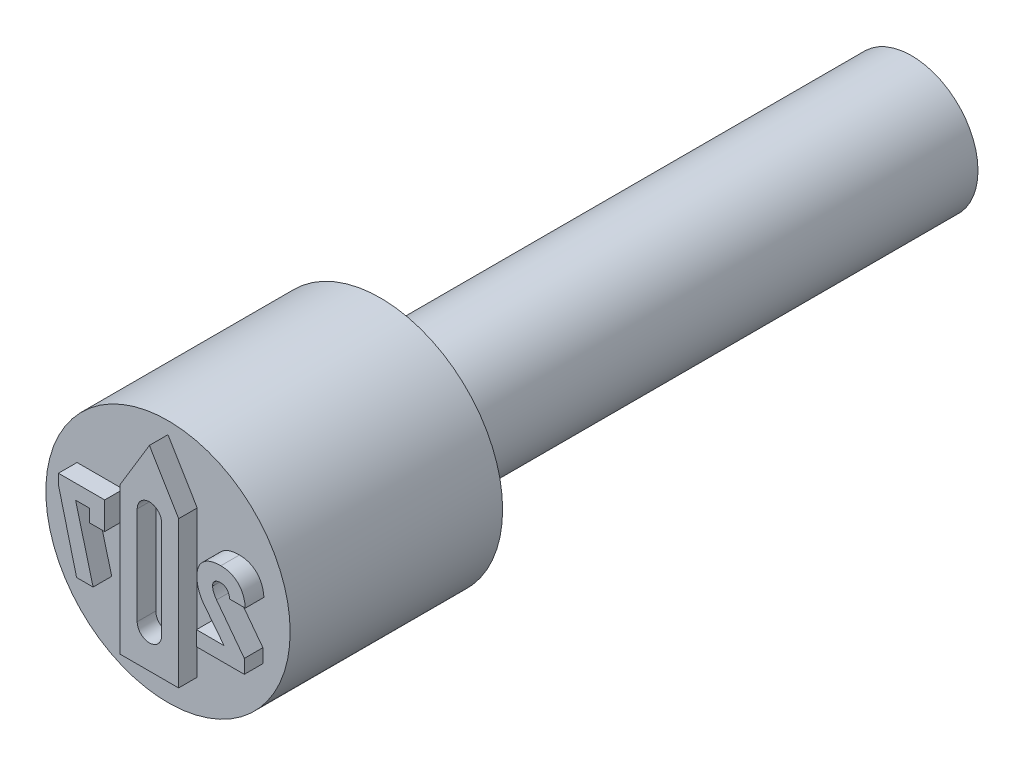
from build123d import *

# Parameters (mm, degrees)
BOSS_EXTRUDE1_DEPTH = 0.35
CUT_EXTRUDE1_DEPTH  = 0.35


with BuildPart() as part:
    # Sketch2 → Revolve1 (revolve)
    with BuildSketch(Plane(origin=(0, 0, 0), x_dir=(0, 0, -1), z_dir=(1, 0, 0)), mode=Mode.PRIVATE) as revolve1_sk:
        Polygon((0, 2.3), (0, 0), (14, 0), (14, 1.25), (4, 1.25), (4, 2.3), align=None)
    revolve(revolve1_sk.sketch.rotate(Axis((0, 0, -0.403888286), (0, 0, -1)), 90), axis=Axis((0, 0, -0.403888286), (0, 0, -1)))

    # Sketch3 → Boss-Extrude1 (add)
    with BuildSketch(Plane.XY):
        Polygon((-0.55, -1.61), (0.55, -1.61), (0.55, 1.15), (0, 2.07), (-0.55, 1.15925817), align=None)
        with BuildLine():
            Line((1.786678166, -0.77), (1.786678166, -0.509825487))
            Line((1.786678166, -0.509825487), (1.263845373, 0.182834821))
            add(Edge.make_bspline(
                [(1.263845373, 0.182834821), (1.252894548, 0.19826512), (1.231557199, 0.228330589), (1.212245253, 0.269619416), (1.200214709, 0.30199037), (1.194481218, 0.325465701), (1.190391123, 0.347863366), (1.189887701, 0.362580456), (1.189642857, 0.369738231)],
                knots=[0, 0, 0, 0, 1.664252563, 3.24274559, 3.998498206, 4.704056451, 5.369707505, 6, 6, 6, 6], degree=3))
            Line((1.189642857, 0.369738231), (1.189642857, 0.371911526))
            add(Edge.make_bspline(
                [(1.189642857, 0.371911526), (1.190066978, 0.381694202), (1.190879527, 0.400436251), (1.198535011, 0.426844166), (1.211081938, 0.449841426), (1.229052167, 0.468837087), (1.251423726, 0.483861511), (1.278191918, 0.494449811), (1.309006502, 0.500521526), (1.330878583, 0.501285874), (1.342394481, 0.501688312)],
                knots=[0, 0, 0, 0, 1.029992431, 1.973301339, 2.872554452, 3.768620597, 4.704316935, 5.693697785, 6.785705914, 8, 8, 8, 8], degree=3))
            add(Edge.make_bspline(
                [(1.342394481, 0.501688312), (1.353642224, 0.501249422), (1.375496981, 0.500396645), (1.406436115, 0.49094547), (1.434315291, 0.476120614), (1.458349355, 0.454967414), (1.478251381, 0.428408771), (1.494403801, 0.397133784), (1.505374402, 0.360577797), (1.509255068, 0.334409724), (1.511290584, 0.320683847)],
                knots=[0, 0, 0, 0, 0.980828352, 1.905783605, 2.800718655, 3.724477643, 4.680224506, 5.688112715, 6.78735127, 8, 8, 8, 8], degree=3))
            Line((1.511290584, 0.320683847), (1.805616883, 0.319752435))
            add(Edge.make_bspline(
                [(1.805616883, 0.319752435), (1.804164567, 0.3384187), (1.801329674, 0.373036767), (1.792035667, 0.423113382), (1.780023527, 0.470282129), (1.764742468, 0.514533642), (1.745106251, 0.555355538), (1.723044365, 0.593601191), (1.696509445, 0.628087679), (1.667463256, 0.659968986), (1.635110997, 0.688049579), (1.600614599, 0.71282043), (1.563452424, 0.733433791), (1.524189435, 0.750533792), (1.482390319, 0.76351221), (1.438601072, 0.773234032), (1.392319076, 0.778840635), (1.360727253, 0.779521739), (1.344567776, 0.77987013)],
                knots=[0, 0, 0, 0, 1.173229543, 2.290119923, 3.354877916, 4.382703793, 5.372196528, 6.339367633, 7.289741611, 8.236749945, 9.180232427, 10.11040526, 11.033485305, 11.978374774, 12.930610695, 13.916256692, 14.93414813, 16, 16, 16, 16], degree=3))
            add(Edge.make_bspline(
                [(1.344567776, 0.77987013), (1.327167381, 0.779622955), (1.293325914, 0.779142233), (1.244058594, 0.773952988), (1.19770327, 0.766120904), (1.154334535, 0.754662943), (1.114126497, 0.739717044), (1.076958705, 0.721695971), (1.042753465, 0.700446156), (1.011772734, 0.675922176), (0.983897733, 0.648569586), (0.959904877, 0.618110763), (0.939135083, 0.585161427), (0.922899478, 0.549082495), (0.909533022, 0.510722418), (0.900878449, 0.469393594), (0.895046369, 0.425582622), (0.894403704, 0.395424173), (0.894074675, 0.379983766)],
                knots=[0, 0, 0, 0, 1.219700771, 2.37215663, 3.469774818, 4.513610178, 5.512457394, 6.473141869, 7.405450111, 8.330272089, 9.238546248, 10.1372905, 11.043445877, 11.962355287, 12.905558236, 13.886315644, 14.917844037, 16, 16, 16, 16], degree=3))
            Line((0.894074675, 0.379983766), (0.894074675, 0.378741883))
            add(Edge.make_bspline(
                [(0.894074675, 0.378741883), (0.894470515, 0.361333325), (0.895262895, 0.326485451), (0.902415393, 0.274330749), (0.913941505, 0.22244232), (0.929770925, 0.171070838), (0.949435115, 0.121106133), (0.973035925, 0.073232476), (0.999672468, 0.027428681), (1.020779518, -0.000840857), (1.03130276, -0.014935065)],
                knots=[0, 0, 0, 0, 0.984368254, 1.970475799, 2.971844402, 3.988480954, 5.008197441, 6.005725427, 7.005724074, 8, 8, 8, 8], degree=3))
            Line((1.03130276, -0.014935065), (1.406351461, -0.491818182))
            Line((1.406351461, -0.491818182), (0.885691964, -0.491818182))
            Line((0.885691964, -0.491818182), (0.885691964, -0.77))
            Line((0.885691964, -0.77), (1.786678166, -0.77))
        make_face()
        Polygon((-1.712439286, 0.76), (-1.712439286, 0.568129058), (-1.370921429, -0.77), (-1.059829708, -0.77), (-1.390791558, 0.481818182), (-1.129064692, 0.481818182), (-1.129064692, 0.243376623), (-0.841879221, 0.243376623), (-0.841879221, 0.76), align=None)
    extrude(amount=BOSS_EXTRUDE1_DEPTH)

    # Sketch4 → Cut-Extrude1 (cut)
    with BuildSketch(Plane.XY.offset(0.35)):
        with BuildLine():
            Line((-0.23, 0.92), (-0.23, -0.92))
            ThreePointArc((-0.23, -0.92), (0, -1.15), (0.23, -0.92))
            Line((0.23, -0.92), (0.23, 0.92))
            ThreePointArc((0.23, 0.92), (0, 1.15), (-0.23, 0.92))
        make_face()
    extrude(amount=-CUT_EXTRUDE1_DEPTH, mode=Mode.SUBTRACT)


solid = part.part
